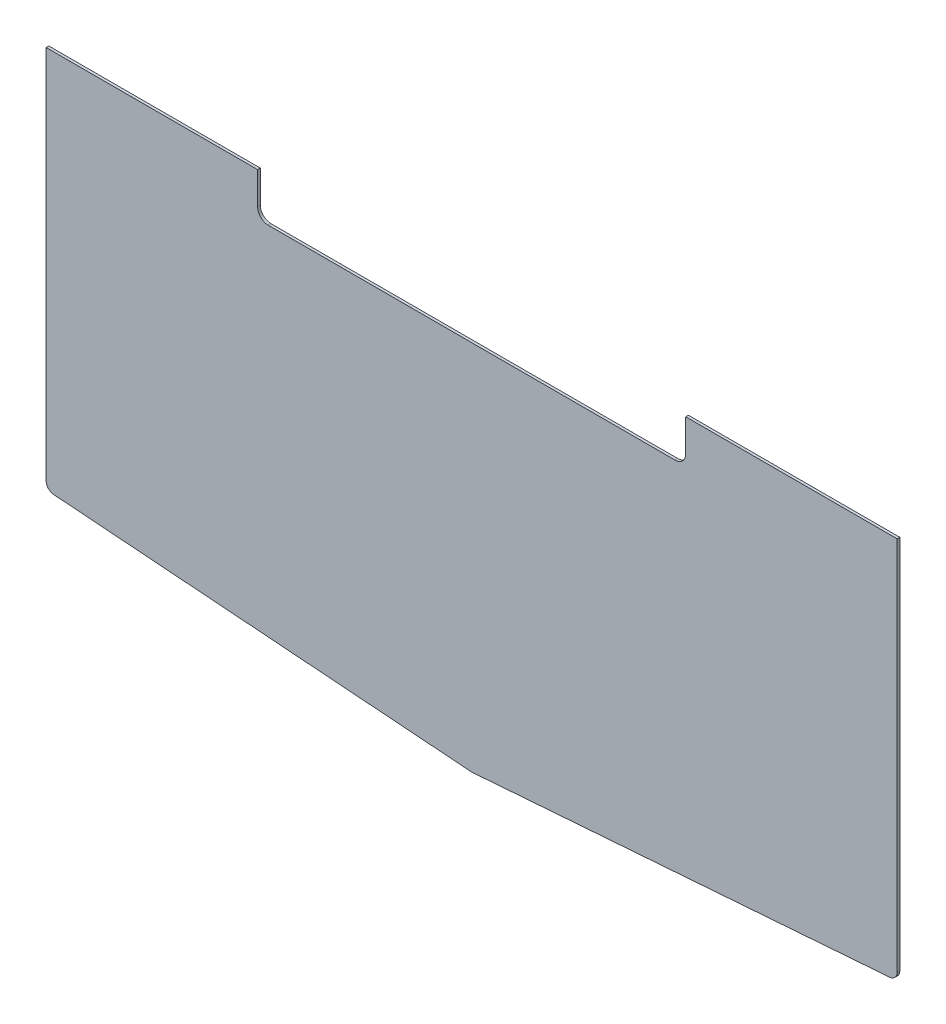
ISO-10303-21;
HEADER;
FILE_DESCRIPTION(('STEP AP214'),'2;1');
FILE_NAME('part.step','',(''),(''),'','','');
FILE_SCHEMA(('AUTOMOTIVE_DESIGN { 1 0 10303 214 1 1 1 1 }'));
ENDSEC;
DATA;
#1=APPLICATION_CONTEXT('core data for automotive mechanical design processes');
#2=APPLICATION_PROTOCOL_DEFINITION('international standard','automotive_design',2000,#1);
#3=PRODUCT_CONTEXT('',#1,'mechanical');
#4=PRODUCT('Part','Part','',(#3));
#5=PRODUCT_RELATED_PRODUCT_CATEGORY('part','',(#4));
#6=PRODUCT_DEFINITION_FORMATION('','',#4);
#7=PRODUCT_DEFINITION_CONTEXT('part definition',#1,'design');
#8=PRODUCT_DEFINITION('design','',#6,#7);
#9=PRODUCT_DEFINITION_SHAPE('','',#8);
#10=(LENGTH_UNIT() NAMED_UNIT(*) SI_UNIT(.MILLI.,.METRE.));
#11=(NAMED_UNIT(*) PLANE_ANGLE_UNIT() SI_UNIT($,.RADIAN.));
#12=(NAMED_UNIT(*) SI_UNIT($,.STERADIAN.) SOLID_ANGLE_UNIT());
#13=UNCERTAINTY_MEASURE_WITH_UNIT(LENGTH_MEASURE(1.E-05),#10,'distance_accuracy_value','');
#14=(GEOMETRIC_REPRESENTATION_CONTEXT(3) GLOBAL_UNCERTAINTY_ASSIGNED_CONTEXT((#13)) GLOBAL_UNIT_ASSIGNED_CONTEXT((#10,
#11,#12)) REPRESENTATION_CONTEXT('',''));
#15=CARTESIAN_POINT('',(0.,0.,0.));
#16=DIRECTION('',(0.,0.,1.));
#17=DIRECTION('',(1.,0.,0.));
#18=AXIS2_PLACEMENT_3D('',#15,#16,#17);
#19=CARTESIAN_POINT('',(252.4125,330.2,1.5875));
#20=DIRECTION('',(0.,-1.,0.));
#21=DIRECTION('',(0.,0.,-1.));
#22=AXIS2_PLACEMENT_3D('',#19,#20,#21);
#23=PLANE('',#22);
#24=DIRECTION('',(-1.,0.,0.));
#25=VECTOR('',#24,1.);
#26=CARTESIAN_POINT('',(252.4125,330.2,1.5875));
#27=LINE('',#26,#25);
#28=CARTESIAN_POINT('',(-127.,330.2,1.5875));
#29=VERTEX_POINT('',#28);
#30=CARTESIAN_POINT('',(-252.4125,330.2,1.5875));
#31=VERTEX_POINT('',#30);
#32=EDGE_CURVE('E289',#29,#31,#27,.T.);
#33=ORIENTED_EDGE('',*,*,#32,.F.);
#34=DIRECTION('',(0.,0.,1.));
#35=VECTOR('',#34,1.);
#36=CARTESIAN_POINT('',(-127.,330.2,0.));
#37=LINE('',#36,#35);
#38=CARTESIAN_POINT('',(-127.,330.2,0.));
#39=VERTEX_POINT('',#38);
#40=EDGE_CURVE('E154',#39,#29,#37,.T.);
#41=ORIENTED_EDGE('',*,*,#40,.F.);
#42=DIRECTION('',(-1.,0.,0.));
#43=VECTOR('',#42,1.);
#44=CARTESIAN_POINT('',(252.4125,330.2,0.));
#45=LINE('',#44,#43);
#46=CARTESIAN_POINT('',(-252.4125,330.2,0.));
#47=VERTEX_POINT('',#46);
#48=EDGE_CURVE('E161',#39,#47,#45,.T.);
#49=ORIENTED_EDGE('',*,*,#48,.T.);
#50=DIRECTION('',(0.,0.,-1.));
#51=VECTOR('',#50,1.);
#52=CARTESIAN_POINT('',(-252.4125,330.2,1.5875));
#53=LINE('',#52,#51);
#54=EDGE_CURVE('E172',#31,#47,#53,.T.);
#55=ORIENTED_EDGE('',*,*,#54,.F.);
#56=EDGE_LOOP('',(#33,#41,#49,#55));
#57=FACE_BOUND('',#56,.T.);
#58=ADVANCED_FACE('F31',(#57),#23,.F.);
#59=CARTESIAN_POINT('',(-247.65,107.491584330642,1.5875));
#60=DIRECTION('',(0.,0.,-1.));
#61=DIRECTION('',(-1.,0.,0.));
#62=AXIS2_PLACEMENT_3D('',#59,#60,#61);
#63=CYLINDRICAL_SURFACE('',#62,4.76249999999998);
#64=CARTESIAN_POINT('',(-247.65,107.491584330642,0.));
#65=DIRECTION('',(0.,0.,1.));
#66=DIRECTION('',(1.,0.,0.));
#67=AXIS2_PLACEMENT_3D('',#64,#65,#66);
#68=CIRCLE('',#67,4.76249999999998);
#69=CARTESIAN_POINT('',(-252.4125,107.491584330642,0.));
#70=VERTEX_POINT('',#69);
#71=CARTESIAN_POINT('',(-248.006187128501,102.742422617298,0.));
#72=VERTEX_POINT('',#71);
#73=EDGE_CURVE('E270',#70,#72,#68,.T.);
#74=ORIENTED_EDGE('',*,*,#73,.T.);
#75=DIRECTION('',(0.,0.,-1.));
#76=VECTOR('',#75,1.);
#77=CARTESIAN_POINT('',(-248.006187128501,102.742422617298,1.5875));
#78=LINE('',#77,#76);
#79=CARTESIAN_POINT('',(-248.006187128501,102.742422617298,1.5875));
#80=VERTEX_POINT('',#79);
#81=EDGE_CURVE('E189',#80,#72,#78,.T.);
#82=ORIENTED_EDGE('',*,*,#81,.F.);
#83=CARTESIAN_POINT('',(-247.65,107.491584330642,1.5875));
#84=DIRECTION('',(0.,0.,1.));
#85=DIRECTION('',(1.,0.,0.));
#86=AXIS2_PLACEMENT_3D('',#83,#84,#85);
#87=CIRCLE('',#86,4.76249999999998);
#88=CARTESIAN_POINT('',(-252.4125,107.491584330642,1.5875));
#89=VERTEX_POINT('',#88);
#90=EDGE_CURVE('E163',#89,#80,#87,.T.);
#91=ORIENTED_EDGE('',*,*,#90,.F.);
#92=DIRECTION('',(0.,0.,-1.));
#93=VECTOR('',#92,1.);
#94=CARTESIAN_POINT('',(-252.4125,107.491584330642,1.5875));
#95=LINE('',#94,#93);
#96=EDGE_CURVE('E169',#89,#70,#95,.T.);
#97=ORIENTED_EDGE('',*,*,#96,.T.);
#98=EDGE_LOOP('',(#74,#82,#91,#97));
#99=FACE_BOUND('',#98,.T.);
#100=ADVANCED_FACE('F223',(#99),#63,.T.);
#101=CARTESIAN_POINT('',(-248.006187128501,102.742422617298,1.5875));
#102=DIRECTION('',(0.0747899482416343,0.997199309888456,0.));
#103=DIRECTION('',(-0.997199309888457,0.0747899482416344,0.));
#104=AXIS2_PLACEMENT_3D('',#101,#102,#103);
#105=PLANE('',#104);
#106=DIRECTION('',(0.997199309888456,-0.0747899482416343,0.));
#107=VECTOR('',#106,1.);
#108=CARTESIAN_POINT('',(-248.006187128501,102.742422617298,0.));
#109=LINE('',#108,#107);
#110=CARTESIAN_POINT('',(-0.356187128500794,84.168672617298,0.));
#111=VERTEX_POINT('',#110);
#112=EDGE_CURVE('E263',#72,#111,#109,.T.);
#113=ORIENTED_EDGE('',*,*,#112,.T.);
#114=DIRECTION('',(0.,0.,-1.));
#115=VECTOR('',#114,1.);
#116=CARTESIAN_POINT('',(-0.356187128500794,84.168672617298,1.5875));
#117=LINE('',#116,#115);
#118=CARTESIAN_POINT('',(-0.356187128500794,84.168672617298,1.5875));
#119=VERTEX_POINT('',#118);
#120=EDGE_CURVE('E186',#119,#111,#117,.T.);
#121=ORIENTED_EDGE('',*,*,#120,.F.);
#122=DIRECTION('',(0.997199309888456,-0.0747899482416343,0.));
#123=VECTOR('',#122,1.);
#124=CARTESIAN_POINT('',(-248.006187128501,102.742422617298,1.5875));
#125=LINE('',#124,#123);
#126=EDGE_CURVE('E302',#80,#119,#125,.T.);
#127=ORIENTED_EDGE('',*,*,#126,.F.);
#128=ORIENTED_EDGE('',*,*,#81,.T.);
#129=EDGE_LOOP('',(#113,#121,#127,#128));
#130=FACE_BOUND('',#129,.T.);
#131=ADVANCED_FACE('F229',(#130),#105,.F.);
#132=CARTESIAN_POINT('',(0.,88.9178343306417,1.5875));
#133=DIRECTION('',(0.,0.,-1.));
#134=DIRECTION('',(-1.,0.,0.));
#135=AXIS2_PLACEMENT_3D('',#132,#133,#134);
#136=CYLINDRICAL_SURFACE('',#135,4.7625);
#137=CARTESIAN_POINT('',(0.,88.9178343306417,0.));
#138=DIRECTION('',(0.,0.,1.));
#139=DIRECTION('',(1.,0.,0.));
#140=AXIS2_PLACEMENT_3D('',#137,#138,#139);
#141=CIRCLE('',#140,4.7625);
#142=CARTESIAN_POINT('',(0.356187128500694,84.168672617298,0.));
#143=VERTEX_POINT('',#142);
#144=EDGE_CURVE('E269',#111,#143,#141,.T.);
#145=ORIENTED_EDGE('',*,*,#144,.T.);
#146=DIRECTION('',(0.,0.,-1.));
#147=VECTOR('',#146,1.);
#148=CARTESIAN_POINT('',(0.356187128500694,84.168672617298,1.5875));
#149=LINE('',#148,#147);
#150=CARTESIAN_POINT('',(0.356187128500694,84.168672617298,1.5875));
#151=VERTEX_POINT('',#150);
#152=EDGE_CURVE('E183',#151,#143,#149,.T.);
#153=ORIENTED_EDGE('',*,*,#152,.F.);
#154=CARTESIAN_POINT('',(0.,88.9178343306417,1.5875));
#155=DIRECTION('',(0.,0.,1.));
#156=DIRECTION('',(1.,0.,0.));
#157=AXIS2_PLACEMENT_3D('',#154,#155,#156);
#158=CIRCLE('',#157,4.7625);
#159=EDGE_CURVE('E273',#119,#151,#158,.T.);
#160=ORIENTED_EDGE('',*,*,#159,.F.);
#161=ORIENTED_EDGE('',*,*,#120,.T.);
#162=EDGE_LOOP('',(#145,#153,#160,#161));
#163=FACE_BOUND('',#162,.T.);
#164=ADVANCED_FACE('F253',(#163),#136,.T.);
#165=CARTESIAN_POINT('',(0.356187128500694,84.168672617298,1.5875));
#166=DIRECTION('',(-0.0747899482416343,0.997199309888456,0.));
#167=DIRECTION('',(-0.997199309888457,-0.0747899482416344,0.));
#168=AXIS2_PLACEMENT_3D('',#165,#166,#167);
#169=PLANE('',#168);
#170=DIRECTION('',(0.997199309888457,0.0747899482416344,0.));
#171=VECTOR('',#170,1.);
#172=CARTESIAN_POINT('',(0.356187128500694,84.168672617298,0.));
#173=LINE('',#172,#171);
#174=CARTESIAN_POINT('',(248.006187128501,102.742422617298,0.));
#175=VERTEX_POINT('',#174);
#176=EDGE_CURVE('E276',#143,#175,#173,.T.);
#177=ORIENTED_EDGE('',*,*,#176,.T.);
#178=DIRECTION('',(0.,0.,-1.));
#179=VECTOR('',#178,1.);
#180=CARTESIAN_POINT('',(248.006187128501,102.742422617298,1.5875));
#181=LINE('',#180,#179);
#182=CARTESIAN_POINT('',(248.006187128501,102.742422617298,1.5875));
#183=VERTEX_POINT('',#182);
#184=EDGE_CURVE('E180',#183,#175,#181,.T.);
#185=ORIENTED_EDGE('',*,*,#184,.F.);
#186=DIRECTION('',(0.997199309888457,0.0747899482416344,0.));
#187=VECTOR('',#186,1.);
#188=CARTESIAN_POINT('',(0.356187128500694,84.168672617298,1.5875));
#189=LINE('',#188,#187);
#190=EDGE_CURVE('E287',#151,#183,#189,.T.);
#191=ORIENTED_EDGE('',*,*,#190,.F.);
#192=ORIENTED_EDGE('',*,*,#152,.T.);
#193=EDGE_LOOP('',(#177,#185,#191,#192));
#194=FACE_BOUND('',#193,.T.);
#195=ADVANCED_FACE('F247',(#194),#169,.F.);
#196=CARTESIAN_POINT('',(247.65,107.491584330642,1.5875));
#197=DIRECTION('',(0.,0.,-1.));
#198=DIRECTION('',(-1.,0.,0.));
#199=AXIS2_PLACEMENT_3D('',#196,#197,#198);
#200=CYLINDRICAL_SURFACE('',#199,4.7625);
#201=CARTESIAN_POINT('',(247.65,107.491584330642,0.));
#202=DIRECTION('',(0.,0.,1.));
#203=DIRECTION('',(1.,0.,0.));
#204=AXIS2_PLACEMENT_3D('',#201,#202,#203);
#205=CIRCLE('',#204,4.7625);
#206=CARTESIAN_POINT('',(252.4125,107.491584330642,0.));
#207=VERTEX_POINT('',#206);
#208=EDGE_CURVE('E278',#175,#207,#205,.T.);
#209=ORIENTED_EDGE('',*,*,#208,.T.);
#210=DIRECTION('',(0.,0.,-1.));
#211=VECTOR('',#210,1.);
#212=CARTESIAN_POINT('',(252.4125,107.491584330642,1.5875));
#213=LINE('',#212,#211);
#214=CARTESIAN_POINT('',(252.4125,107.491584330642,1.5875));
#215=VERTEX_POINT('',#214);
#216=EDGE_CURVE('E177',#215,#207,#213,.T.);
#217=ORIENTED_EDGE('',*,*,#216,.F.);
#218=CARTESIAN_POINT('',(247.65,107.491584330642,1.5875));
#219=DIRECTION('',(0.,0.,1.));
#220=DIRECTION('',(1.,0.,0.));
#221=AXIS2_PLACEMENT_3D('',#218,#219,#220);
#222=CIRCLE('',#221,4.7625);
#223=EDGE_CURVE('E285',#183,#215,#222,.T.);
#224=ORIENTED_EDGE('',*,*,#223,.F.);
#225=ORIENTED_EDGE('',*,*,#184,.T.);
#226=EDGE_LOOP('',(#209,#217,#224,#225));
#227=FACE_BOUND('',#226,.T.);
#228=ADVANCED_FACE('F242',(#227),#200,.T.);
#229=CARTESIAN_POINT('',(252.4125,107.491584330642,1.5875));
#230=DIRECTION('',(-1.,0.,0.));
#231=DIRECTION('',(0.,0.,1.));
#232=AXIS2_PLACEMENT_3D('',#229,#230,#231);
#233=PLANE('',#232);
#234=DIRECTION('',(0.,1.,0.));
#235=VECTOR('',#234,1.);
#236=CARTESIAN_POINT('',(252.4125,107.491584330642,0.));
#237=LINE('',#236,#235);
#238=CARTESIAN_POINT('',(252.4125,330.2,0.));
#239=VERTEX_POINT('',#238);
#240=EDGE_CURVE('E165',#207,#239,#237,.T.);
#241=ORIENTED_EDGE('',*,*,#240,.T.);
#242=DIRECTION('',(0.,0.,-1.));
#243=VECTOR('',#242,1.);
#244=CARTESIAN_POINT('',(252.4125,330.2,1.5875));
#245=LINE('',#244,#243);
#246=CARTESIAN_POINT('',(252.4125,330.2,1.5875));
#247=VERTEX_POINT('',#246);
#248=EDGE_CURVE('E159',#247,#239,#245,.T.);
#249=ORIENTED_EDGE('',*,*,#248,.F.);
#250=DIRECTION('',(0.,1.,0.));
#251=VECTOR('',#250,1.);
#252=CARTESIAN_POINT('',(252.4125,107.491584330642,1.5875));
#253=LINE('',#252,#251);
#254=EDGE_CURVE('E283',#215,#247,#253,.T.);
#255=ORIENTED_EDGE('',*,*,#254,.F.);
#256=ORIENTED_EDGE('',*,*,#216,.T.);
#257=EDGE_LOOP('',(#241,#249,#255,#256));
#258=FACE_BOUND('',#257,.T.);
#259=ADVANCED_FACE('F236',(#258),#233,.F.);
#260=CARTESIAN_POINT('',(127.,330.2,0.));
#261=VERTEX_POINT('',#260);
#262=EDGE_CURVE('E137',#239,#261,#45,.T.);
#263=ORIENTED_EDGE('',*,*,#262,.T.);
#264=DIRECTION('',(0.,0.,1.));
#265=VECTOR('',#264,1.);
#266=CARTESIAN_POINT('',(127.,330.2,0.));
#267=LINE('',#266,#265);
#268=CARTESIAN_POINT('',(127.,330.2,1.5875));
#269=VERTEX_POINT('',#268);
#270=EDGE_CURVE('E144',#261,#269,#267,.T.);
#271=ORIENTED_EDGE('',*,*,#270,.T.);
#272=EDGE_CURVE('E294',#247,#269,#27,.T.);
#273=ORIENTED_EDGE('',*,*,#272,.F.);
#274=ORIENTED_EDGE('',*,*,#248,.T.);
#275=EDGE_LOOP('',(#263,#271,#273,#274));
#276=FACE_BOUND('',#275,.T.);
#277=ADVANCED_FACE('F157',(#276),#23,.F.);
#278=CARTESIAN_POINT('',(-252.4125,107.491584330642,1.5875));
#279=DIRECTION('',(1.,0.,0.));
#280=DIRECTION('',(0.,1.,0.));
#281=AXIS2_PLACEMENT_3D('',#278,#279,#280);
#282=PLANE('',#281);
#283=DIRECTION('',(0.,-1.,0.));
#284=VECTOR('',#283,1.);
#285=CARTESIAN_POINT('',(-252.4125,107.491584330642,0.));
#286=LINE('',#285,#284);
#287=EDGE_CURVE('E160',#47,#70,#286,.T.);
#288=ORIENTED_EDGE('',*,*,#287,.T.);
#289=ORIENTED_EDGE('',*,*,#96,.F.);
#290=DIRECTION('',(0.,-1.,0.));
#291=VECTOR('',#290,1.);
#292=CARTESIAN_POINT('',(-252.4125,107.491584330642,1.5875));
#293=LINE('',#292,#291);
#294=EDGE_CURVE('E173',#31,#89,#293,.T.);
#295=ORIENTED_EDGE('',*,*,#294,.F.);
#296=ORIENTED_EDGE('',*,*,#54,.T.);
#297=EDGE_LOOP('',(#288,#289,#295,#296));
#298=FACE_BOUND('',#297,.T.);
#299=ADVANCED_FACE('F235',(#298),#282,.F.);
#300=CARTESIAN_POINT('',(-247.65,107.491584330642,1.5875));
#301=DIRECTION('',(0.,0.,1.));
#302=DIRECTION('',(1.,0.,0.));
#303=AXIS2_PLACEMENT_3D('',#300,#301,#302);
#304=PLANE('',#303);
#305=DIRECTION('',(0.,-1.,0.));
#306=VECTOR('',#305,1.);
#307=CARTESIAN_POINT('',(-127.,330.2,1.5875));
#308=LINE('',#307,#306);
#309=CARTESIAN_POINT('',(-127.,311.15,1.5875));
#310=VERTEX_POINT('',#309);
#311=EDGE_CURVE('E211',#29,#310,#308,.T.);
#312=ORIENTED_EDGE('',*,*,#311,.F.);
#313=ORIENTED_EDGE('',*,*,#32,.T.);
#314=ORIENTED_EDGE('',*,*,#294,.T.);
#315=ORIENTED_EDGE('',*,*,#90,.T.);
#316=ORIENTED_EDGE('',*,*,#126,.T.);
#317=ORIENTED_EDGE('',*,*,#159,.T.);
#318=ORIENTED_EDGE('',*,*,#190,.T.);
#319=ORIENTED_EDGE('',*,*,#223,.T.);
#320=ORIENTED_EDGE('',*,*,#254,.T.);
#321=ORIENTED_EDGE('',*,*,#272,.T.);
#322=DIRECTION('',(0.,1.,0.));
#323=VECTOR('',#322,1.);
#324=CARTESIAN_POINT('',(127.,330.2,1.5875));
#325=LINE('',#324,#323);
#326=CARTESIAN_POINT('',(127.,311.15,1.5875));
#327=VERTEX_POINT('',#326);
#328=EDGE_CURVE('E150',#327,#269,#325,.T.);
#329=ORIENTED_EDGE('',*,*,#328,.F.);
#330=CARTESIAN_POINT('',(120.65,311.15,1.5875));
#331=DIRECTION('',(0.,0.,1.));
#332=DIRECTION('',(1.,0.,0.));
#333=AXIS2_PLACEMENT_3D('',#330,#331,#332);
#334=CIRCLE('',#333,6.35);
#335=CARTESIAN_POINT('',(120.65,304.8,1.5875));
#336=VERTEX_POINT('',#335);
#337=EDGE_CURVE('E200',#327,#336,#334,.F.);
#338=ORIENTED_EDGE('',*,*,#337,.T.);
#339=DIRECTION('',(1.,0.,0.));
#340=VECTOR('',#339,1.);
#341=CARTESIAN_POINT('',(-127.,304.8,1.5875));
#342=LINE('',#341,#340);
#343=CARTESIAN_POINT('',(-120.65,304.8,1.5875));
#344=VERTEX_POINT('',#343);
#345=EDGE_CURVE('E204',#344,#336,#342,.T.);
#346=ORIENTED_EDGE('',*,*,#345,.F.);
#347=CARTESIAN_POINT('',(-120.65,311.15,1.5875));
#348=DIRECTION('',(0.,0.,1.));
#349=DIRECTION('',(1.,0.,0.));
#350=AXIS2_PLACEMENT_3D('',#347,#348,#349);
#351=CIRCLE('',#350,6.35);
#352=EDGE_CURVE('E39',#344,#310,#351,.F.);
#353=ORIENTED_EDGE('',*,*,#352,.T.);
#354=EDGE_LOOP('',(#312,#313,#314,#315,#316,#317,#318,#319,#320,#321,#329,#338,#346,#353));
#355=FACE_BOUND('',#354,.T.);
#356=ADVANCED_FACE('F203',(#355),#304,.T.);
#357=CARTESIAN_POINT('',(-247.65,107.491584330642,0.));
#358=DIRECTION('',(0.,0.,1.));
#359=DIRECTION('',(1.,0.,0.));
#360=AXIS2_PLACEMENT_3D('',#357,#358,#359);
#361=PLANE('',#360);
#362=ORIENTED_EDGE('',*,*,#48,.F.);
#363=DIRECTION('',(0.,-1.,0.));
#364=VECTOR('',#363,1.);
#365=CARTESIAN_POINT('',(-127.,330.2,0.));
#366=LINE('',#365,#364);
#367=CARTESIAN_POINT('',(-127.,311.15,0.));
#368=VERTEX_POINT('',#367);
#369=EDGE_CURVE('E312',#39,#368,#366,.T.);
#370=ORIENTED_EDGE('',*,*,#369,.T.);
#371=CARTESIAN_POINT('',(-120.65,311.15,0.));
#372=DIRECTION('',(0.,0.,1.));
#373=DIRECTION('',(1.,0.,0.));
#374=AXIS2_PLACEMENT_3D('',#371,#372,#373);
#375=CIRCLE('',#374,6.35);
#376=CARTESIAN_POINT('',(-120.65,304.8,0.));
#377=VERTEX_POINT('',#376);
#378=EDGE_CURVE('E11',#368,#377,#375,.T.);
#379=ORIENTED_EDGE('',*,*,#378,.T.);
#380=DIRECTION('',(1.,0.,0.));
#381=VECTOR('',#380,1.);
#382=CARTESIAN_POINT('',(-127.,304.8,0.));
#383=LINE('',#382,#381);
#384=CARTESIAN_POINT('',(120.65,304.8,0.));
#385=VERTEX_POINT('',#384);
#386=EDGE_CURVE('E145',#377,#385,#383,.T.);
#387=ORIENTED_EDGE('',*,*,#386,.T.);
#388=CARTESIAN_POINT('',(120.65,311.15,0.));
#389=DIRECTION('',(0.,0.,1.));
#390=DIRECTION('',(1.,0.,0.));
#391=AXIS2_PLACEMENT_3D('',#388,#389,#390);
#392=CIRCLE('',#391,6.35);
#393=CARTESIAN_POINT('',(127.,311.15,0.));
#394=VERTEX_POINT('',#393);
#395=EDGE_CURVE('E140',#385,#394,#392,.T.);
#396=ORIENTED_EDGE('',*,*,#395,.T.);
#397=DIRECTION('',(0.,1.,0.));
#398=VECTOR('',#397,1.);
#399=CARTESIAN_POINT('',(127.,330.2,0.));
#400=LINE('',#399,#398);
#401=EDGE_CURVE('E131',#394,#261,#400,.T.);
#402=ORIENTED_EDGE('',*,*,#401,.T.);
#403=ORIENTED_EDGE('',*,*,#262,.F.);
#404=ORIENTED_EDGE('',*,*,#240,.F.);
#405=ORIENTED_EDGE('',*,*,#208,.F.);
#406=ORIENTED_EDGE('',*,*,#176,.F.);
#407=ORIENTED_EDGE('',*,*,#144,.F.);
#408=ORIENTED_EDGE('',*,*,#112,.F.);
#409=ORIENTED_EDGE('',*,*,#73,.F.);
#410=ORIENTED_EDGE('',*,*,#287,.F.);
#411=EDGE_LOOP('',(#362,#370,#379,#387,#396,#402,#403,#404,#405,#406,#407,#408,#409,#410));
#412=FACE_BOUND('',#411,.T.);
#413=ADVANCED_FACE('F134',(#412),#361,.F.);
#414=CARTESIAN_POINT('',(-127.,330.2,0.));
#415=DIRECTION('',(-1.,0.,0.));
#416=DIRECTION('',(0.,0.,1.));
#417=AXIS2_PLACEMENT_3D('',#414,#415,#416);
#418=PLANE('',#417);
#419=ORIENTED_EDGE('',*,*,#311,.T.);
#420=DIRECTION('',(0.,0.,1.));
#421=VECTOR('',#420,1.);
#422=CARTESIAN_POINT('',(-127.,311.15,0.));
#423=LINE('',#422,#421);
#424=EDGE_CURVE('E46',#310,#368,#423,.F.);
#425=ORIENTED_EDGE('',*,*,#424,.T.);
#426=ORIENTED_EDGE('',*,*,#369,.F.);
#427=ORIENTED_EDGE('',*,*,#40,.T.);
#428=EDGE_LOOP('',(#419,#425,#426,#427));
#429=FACE_BOUND('',#428,.T.);
#430=ADVANCED_FACE('F314',(#429),#418,.F.);
#431=CARTESIAN_POINT('',(127.,330.2,0.));
#432=DIRECTION('',(1.,0.,0.));
#433=DIRECTION('',(0.,0.,-1.));
#434=AXIS2_PLACEMENT_3D('',#431,#432,#433);
#435=PLANE('',#434);
#436=ORIENTED_EDGE('',*,*,#401,.F.);
#437=DIRECTION('',(0.,0.,1.));
#438=VECTOR('',#437,1.);
#439=CARTESIAN_POINT('',(127.,311.15,1.5875));
#440=LINE('',#439,#438);
#441=EDGE_CURVE('E192',#394,#327,#440,.T.);
#442=ORIENTED_EDGE('',*,*,#441,.T.);
#443=ORIENTED_EDGE('',*,*,#328,.T.);
#444=ORIENTED_EDGE('',*,*,#270,.F.);
#445=EDGE_LOOP('',(#436,#442,#443,#444));
#446=FACE_BOUND('',#445,.T.);
#447=ADVANCED_FACE('F148',(#446),#435,.F.);
#448=CARTESIAN_POINT('',(-127.,304.8,0.));
#449=DIRECTION('',(0.,-1.,0.));
#450=DIRECTION('',(0.,0.,-1.));
#451=AXIS2_PLACEMENT_3D('',#448,#449,#450);
#452=PLANE('',#451);
#453=ORIENTED_EDGE('',*,*,#345,.T.);
#454=DIRECTION('',(0.,0.,1.));
#455=VECTOR('',#454,1.);
#456=CARTESIAN_POINT('',(120.65,304.8,0.));
#457=LINE('',#456,#455);
#458=EDGE_CURVE('E197',#336,#385,#457,.F.);
#459=ORIENTED_EDGE('',*,*,#458,.T.);
#460=ORIENTED_EDGE('',*,*,#386,.F.);
#461=DIRECTION('',(0.,0.,1.));
#462=VECTOR('',#461,1.);
#463=CARTESIAN_POINT('',(-120.65,304.8,1.5875));
#464=LINE('',#463,#462);
#465=EDGE_CURVE('E194',#377,#344,#464,.T.);
#466=ORIENTED_EDGE('',*,*,#465,.T.);
#467=EDGE_LOOP('',(#453,#459,#460,#466));
#468=FACE_BOUND('',#467,.T.);
#469=ADVANCED_FACE('F208',(#468),#452,.F.);
#470=CARTESIAN_POINT('',(120.65,311.15,0.));
#471=DIRECTION('',(0.,0.,-1.));
#472=DIRECTION('',(-1.,0.,0.));
#473=AXIS2_PLACEMENT_3D('',#470,#471,#472);
#474=CYLINDRICAL_SURFACE('',#473,6.35);
#475=ORIENTED_EDGE('',*,*,#395,.F.);
#476=ORIENTED_EDGE('',*,*,#458,.F.);
#477=ORIENTED_EDGE('',*,*,#337,.F.);
#478=ORIENTED_EDGE('',*,*,#441,.F.);
#479=EDGE_LOOP('',(#475,#476,#477,#478));
#480=FACE_BOUND('',#479,.T.);
#481=ADVANCED_FACE('F213',(#480),#474,.F.);
#482=CARTESIAN_POINT('',(-120.65,311.15,0.));
#483=DIRECTION('',(0.,0.,-1.));
#484=DIRECTION('',(-1.,0.,0.));
#485=AXIS2_PLACEMENT_3D('',#482,#483,#484);
#486=CYLINDRICAL_SURFACE('',#485,6.35);
#487=ORIENTED_EDGE('',*,*,#378,.F.);
#488=ORIENTED_EDGE('',*,*,#424,.F.);
#489=ORIENTED_EDGE('',*,*,#352,.F.);
#490=ORIENTED_EDGE('',*,*,#465,.F.);
#491=EDGE_LOOP('',(#487,#488,#489,#490));
#492=FACE_BOUND('',#491,.T.);
#493=ADVANCED_FACE('F33',(#492),#486,.F.);
#494=CLOSED_SHELL('',(#58,#100,#131,#164,#195,#228,#259,#277,#299,#356,#413,#430,#447,#469,#481,#493));
#495=MANIFOLD_SOLID_BREP('B2',#494);
#496=ADVANCED_BREP_SHAPE_REPRESENTATION('',(#18,#495),#14);
#497=SHAPE_DEFINITION_REPRESENTATION(#9,#496);
ENDSEC;
END-ISO-10303-21;
